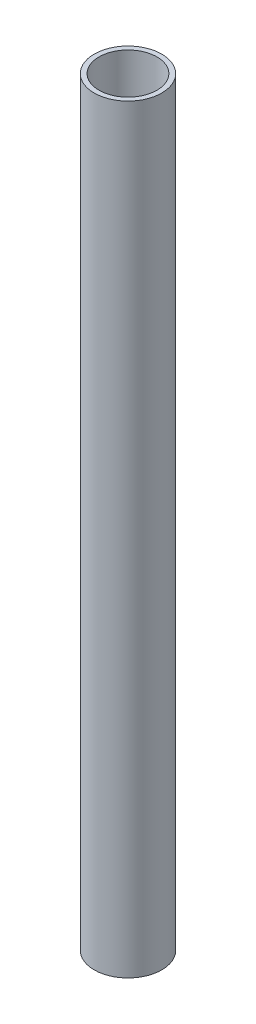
ISO-10303-21;
HEADER;
FILE_DESCRIPTION(('STEP AP214'),'2;1');
FILE_NAME('part.step','',(''),(''),'','','');
FILE_SCHEMA(('AUTOMOTIVE_DESIGN { 1 0 10303 214 1 1 1 1 }'));
ENDSEC;
DATA;
#1=APPLICATION_CONTEXT('core data for automotive mechanical design processes');
#2=APPLICATION_PROTOCOL_DEFINITION('international standard','automotive_design',2000,#1);
#3=PRODUCT_CONTEXT('',#1,'mechanical');
#4=PRODUCT('Part','Part','',(#3));
#5=PRODUCT_RELATED_PRODUCT_CATEGORY('part','',(#4));
#6=PRODUCT_DEFINITION_FORMATION('','',#4);
#7=PRODUCT_DEFINITION_CONTEXT('part definition',#1,'design');
#8=PRODUCT_DEFINITION('design','',#6,#7);
#9=PRODUCT_DEFINITION_SHAPE('','',#8);
#10=(LENGTH_UNIT() NAMED_UNIT(*) SI_UNIT(.MILLI.,.METRE.));
#11=(NAMED_UNIT(*) PLANE_ANGLE_UNIT() SI_UNIT($,.RADIAN.));
#12=(NAMED_UNIT(*) SI_UNIT($,.STERADIAN.) SOLID_ANGLE_UNIT());
#13=UNCERTAINTY_MEASURE_WITH_UNIT(LENGTH_MEASURE(1.E-05),#10,'distance_accuracy_value','');
#14=(GEOMETRIC_REPRESENTATION_CONTEXT(3) GLOBAL_UNCERTAINTY_ASSIGNED_CONTEXT((#13)) GLOBAL_UNIT_ASSIGNED_CONTEXT((#10,
#11,#12)) REPRESENTATION_CONTEXT('',''));
#15=CARTESIAN_POINT('',(0.,0.,0.));
#16=DIRECTION('',(0.,0.,1.));
#17=DIRECTION('',(1.,0.,0.));
#18=AXIS2_PLACEMENT_3D('',#15,#16,#17);
#19=CARTESIAN_POINT('',(0.,500.,0.));
#20=DIRECTION('',(0.,1.,0.));
#21=DIRECTION('',(0.,0.,1.));
#22=AXIS2_PLACEMENT_3D('',#19,#20,#21);
#23=PLANE('',#22);
#24=CARTESIAN_POINT('',(0.,500.,0.));
#25=DIRECTION('',(0.,1.,0.));
#26=DIRECTION('',(0.,0.,1.));
#27=AXIS2_PLACEMENT_3D('',#24,#25,#26);
#28=CIRCLE('',#27,22.225);
#29=CARTESIAN_POINT('',(0.,500.,22.225));
#30=VERTEX_POINT('',#29);
#31=EDGE_CURVE('E10',#30,#30,#28,.T.);
#32=ORIENTED_EDGE('',*,*,#31,.T.);
#33=EDGE_LOOP('',(#32));
#34=FACE_BOUND('',#33,.T.);
#35=CARTESIAN_POINT('',(0.,500.,0.));
#36=DIRECTION('',(0.,1.,0.));
#37=DIRECTION('',(0.,0.,1.));
#38=AXIS2_PLACEMENT_3D('',#35,#36,#37);
#39=CIRCLE('',#38,19.05);
#40=CARTESIAN_POINT('',(0.,500.,19.05));
#41=VERTEX_POINT('',#40);
#42=EDGE_CURVE('E44',#41,#41,#39,.T.);
#43=ORIENTED_EDGE('',*,*,#42,.F.);
#44=EDGE_LOOP('',(#43));
#45=FACE_BOUND('',#44,.T.);
#46=ADVANCED_FACE('F33',(#34,#45),#23,.T.);
#47=CARTESIAN_POINT('',(0.,0.,0.));
#48=DIRECTION('',(0.,1.,0.));
#49=DIRECTION('',(0.,0.,1.));
#50=AXIS2_PLACEMENT_3D('',#47,#48,#49);
#51=PLANE('',#50);
#52=CARTESIAN_POINT('',(0.,0.,0.));
#53=DIRECTION('',(0.,1.,0.));
#54=DIRECTION('',(0.,0.,1.));
#55=AXIS2_PLACEMENT_3D('',#52,#53,#54);
#56=CIRCLE('',#55,22.225);
#57=CARTESIAN_POINT('',(0.,0.,22.225));
#58=VERTEX_POINT('',#57);
#59=EDGE_CURVE('E37',#58,#58,#56,.T.);
#60=ORIENTED_EDGE('',*,*,#59,.F.);
#61=EDGE_LOOP('',(#60));
#62=FACE_BOUND('',#61,.T.);
#63=CARTESIAN_POINT('',(0.,0.,0.));
#64=DIRECTION('',(0.,1.,0.));
#65=DIRECTION('',(0.,0.,1.));
#66=AXIS2_PLACEMENT_3D('',#63,#64,#65);
#67=CIRCLE('',#66,19.05);
#68=CARTESIAN_POINT('',(0.,0.,19.05));
#69=VERTEX_POINT('',#68);
#70=EDGE_CURVE('E46',#69,#69,#67,.T.);
#71=ORIENTED_EDGE('',*,*,#70,.T.);
#72=EDGE_LOOP('',(#71));
#73=FACE_BOUND('',#72,.T.);
#74=ADVANCED_FACE('F56',(#62,#73),#51,.F.);
#75=CARTESIAN_POINT('',(0.,500.,0.));
#76=DIRECTION('',(0.,-1.,0.));
#77=DIRECTION('',(0.,0.,-1.));
#78=AXIS2_PLACEMENT_3D('',#75,#76,#77);
#79=CYLINDRICAL_SURFACE('',#78,22.225);
#80=ORIENTED_EDGE('',*,*,#31,.F.);
#81=EDGE_LOOP('',(#80));
#82=FACE_BOUND('',#81,.T.);
#83=ORIENTED_EDGE('',*,*,#59,.T.);
#84=EDGE_LOOP('',(#83));
#85=FACE_BOUND('',#84,.T.);
#86=ADVANCED_FACE('F35',(#82,#85),#79,.T.);
#87=CARTESIAN_POINT('',(0.,500.,0.));
#88=DIRECTION('',(0.,-1.,0.));
#89=DIRECTION('',(0.,0.,-1.));
#90=AXIS2_PLACEMENT_3D('',#87,#88,#89);
#91=CYLINDRICAL_SURFACE('',#90,19.05);
#92=ORIENTED_EDGE('',*,*,#42,.T.);
#93=EDGE_LOOP('',(#92));
#94=FACE_BOUND('',#93,.T.);
#95=ORIENTED_EDGE('',*,*,#70,.F.);
#96=EDGE_LOOP('',(#95));
#97=FACE_BOUND('',#96,.T.);
#98=ADVANCED_FACE('F52',(#94,#97),#91,.F.);
#99=CLOSED_SHELL('',(#46,#74,#86,#98));
#100=MANIFOLD_SOLID_BREP('B2',#99);
#101=ADVANCED_BREP_SHAPE_REPRESENTATION('',(#18,#100),#14);
#102=SHAPE_DEFINITION_REPRESENTATION(#9,#101);
ENDSEC;
END-ISO-10303-21;
